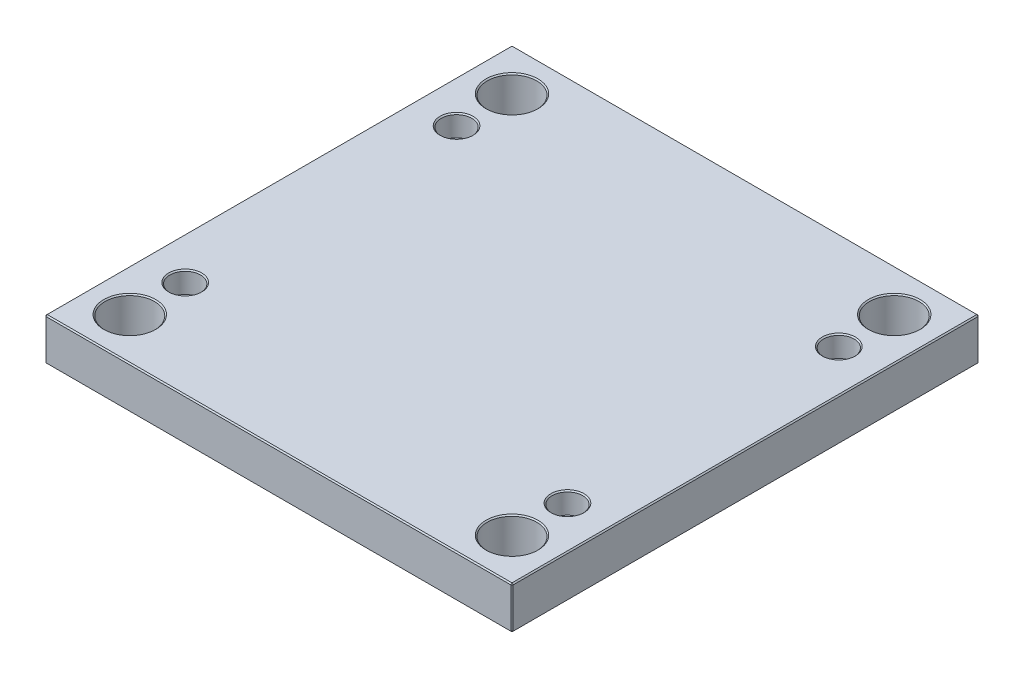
ISO-10303-21;
HEADER;
FILE_DESCRIPTION(('STEP AP214'),'2;1');
FILE_NAME('part.step','',(''),(''),'','','');
FILE_SCHEMA(('AUTOMOTIVE_DESIGN { 1 0 10303 214 1 1 1 1 }'));
ENDSEC;
DATA;
#1=APPLICATION_CONTEXT('core data for automotive mechanical design processes');
#2=APPLICATION_PROTOCOL_DEFINITION('international standard','automotive_design',2000,#1);
#3=PRODUCT_CONTEXT('',#1,'mechanical');
#4=PRODUCT('Part','Part','',(#3));
#5=PRODUCT_RELATED_PRODUCT_CATEGORY('part','',(#4));
#6=PRODUCT_DEFINITION_FORMATION('','',#4);
#7=PRODUCT_DEFINITION_CONTEXT('part definition',#1,'design');
#8=PRODUCT_DEFINITION('design','',#6,#7);
#9=PRODUCT_DEFINITION_SHAPE('','',#8);
#10=(LENGTH_UNIT() NAMED_UNIT(*) SI_UNIT(.MILLI.,.METRE.));
#11=(NAMED_UNIT(*) PLANE_ANGLE_UNIT() SI_UNIT($,.RADIAN.));
#12=(NAMED_UNIT(*) SI_UNIT($,.STERADIAN.) SOLID_ANGLE_UNIT());
#13=UNCERTAINTY_MEASURE_WITH_UNIT(LENGTH_MEASURE(1.E-05),#10,'distance_accuracy_value','');
#14=(GEOMETRIC_REPRESENTATION_CONTEXT(3) GLOBAL_UNCERTAINTY_ASSIGNED_CONTEXT((#13)) GLOBAL_UNIT_ASSIGNED_CONTEXT((#10,
#11,#12)) REPRESENTATION_CONTEXT('',''));
#15=CARTESIAN_POINT('',(0.,0.,0.));
#16=DIRECTION('',(0.,0.,1.));
#17=DIRECTION('',(1.,0.,0.));
#18=AXIS2_PLACEMENT_3D('',#15,#16,#17);
#19=CARTESIAN_POINT('',(-198.,36.,198.));
#20=DIRECTION('',(1.,0.,0.));
#21=DIRECTION('',(0.,0.,-1.));
#22=AXIS2_PLACEMENT_3D('',#19,#20,#21);
#23=PLANE('',#22);
#24=DIRECTION('',(0.,-1.,0.));
#25=VECTOR('',#24,1.);
#26=CARTESIAN_POINT('',(-198.,36.,-197.));
#27=LINE('',#26,#25);
#28=CARTESIAN_POINT('',(-198.,35.,-197.));
#29=VERTEX_POINT('',#28);
#30=CARTESIAN_POINT('',(-198.,1.00000000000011,-197.));
#31=VERTEX_POINT('',#30);
#32=EDGE_CURVE('E115',#29,#31,#27,.T.);
#33=ORIENTED_EDGE('',*,*,#32,.T.);
#34=DIRECTION('',(0.,0.,1.));
#35=VECTOR('',#34,1.);
#36=CARTESIAN_POINT('',(-198.,1.00000000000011,198.));
#37=LINE('',#36,#35);
#38=CARTESIAN_POINT('',(-198.,1.00000000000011,197.));
#39=VERTEX_POINT('',#38);
#40=EDGE_CURVE('E111',#31,#39,#37,.T.);
#41=ORIENTED_EDGE('',*,*,#40,.T.);
#42=DIRECTION('',(0.,1.,0.));
#43=VECTOR('',#42,1.);
#44=CARTESIAN_POINT('',(-198.,36.,197.));
#45=LINE('',#44,#43);
#46=CARTESIAN_POINT('',(-198.,35.,197.));
#47=VERTEX_POINT('',#46);
#48=EDGE_CURVE('E104',#39,#47,#45,.T.);
#49=ORIENTED_EDGE('',*,*,#48,.T.);
#50=DIRECTION('',(0.,0.,-1.));
#51=VECTOR('',#50,1.);
#52=CARTESIAN_POINT('',(-198.,35.,-198.));
#53=LINE('',#52,#51);
#54=EDGE_CURVE('E108',#47,#29,#53,.T.);
#55=ORIENTED_EDGE('',*,*,#54,.T.);
#56=EDGE_LOOP('',(#33,#41,#49,#55));
#57=FACE_BOUND('',#56,.T.);
#58=ADVANCED_FACE('F16',(#57),#23,.F.);
#59=CARTESIAN_POINT('',(198.,36.,198.));
#60=DIRECTION('',(0.,0.,-1.));
#61=DIRECTION('',(-1.,0.,0.));
#62=AXIS2_PLACEMENT_3D('',#59,#60,#61);
#63=PLANE('',#62);
#64=DIRECTION('',(-1.,0.,0.));
#65=VECTOR('',#64,1.);
#66=CARTESIAN_POINT('',(-198.,35.,198.));
#67=LINE('',#66,#65);
#68=CARTESIAN_POINT('',(197.,35.,198.));
#69=VERTEX_POINT('',#68);
#70=CARTESIAN_POINT('',(-197.,35.,198.));
#71=VERTEX_POINT('',#70);
#72=EDGE_CURVE('E170',#69,#71,#67,.T.);
#73=ORIENTED_EDGE('',*,*,#72,.T.);
#74=DIRECTION('',(0.,-1.,0.));
#75=VECTOR('',#74,1.);
#76=CARTESIAN_POINT('',(-197.,36.,198.));
#77=LINE('',#76,#75);
#78=CARTESIAN_POINT('',(-197.,1.00000000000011,198.));
#79=VERTEX_POINT('',#78);
#80=EDGE_CURVE('E123',#71,#79,#77,.T.);
#81=ORIENTED_EDGE('',*,*,#80,.T.);
#82=DIRECTION('',(1.,0.,0.));
#83=VECTOR('',#82,1.);
#84=CARTESIAN_POINT('',(198.,1.00000000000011,198.));
#85=LINE('',#84,#83);
#86=CARTESIAN_POINT('',(197.,1.00000000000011,198.));
#87=VERTEX_POINT('',#86);
#88=EDGE_CURVE('E174',#79,#87,#85,.T.);
#89=ORIENTED_EDGE('',*,*,#88,.T.);
#90=DIRECTION('',(0.,1.,0.));
#91=VECTOR('',#90,1.);
#92=CARTESIAN_POINT('',(197.,36.,198.));
#93=LINE('',#92,#91);
#94=EDGE_CURVE('E172',#87,#69,#93,.T.);
#95=ORIENTED_EDGE('',*,*,#94,.T.);
#96=EDGE_LOOP('',(#73,#81,#89,#95));
#97=FACE_BOUND('',#96,.T.);
#98=ADVANCED_FACE('F413',(#97),#63,.F.);
#99=CARTESIAN_POINT('',(198.,36.,198.));
#100=DIRECTION('',(-1.,0.,0.));
#101=DIRECTION('',(0.,0.,1.));
#102=AXIS2_PLACEMENT_3D('',#99,#100,#101);
#103=PLANE('',#102);
#104=DIRECTION('',(0.,0.,-1.));
#105=VECTOR('',#104,1.);
#106=CARTESIAN_POINT('',(198.,1.00000000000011,198.));
#107=LINE('',#106,#105);
#108=CARTESIAN_POINT('',(198.,1.00000000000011,197.));
#109=VERTEX_POINT('',#108);
#110=CARTESIAN_POINT('',(198.,1.00000000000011,-197.));
#111=VERTEX_POINT('',#110);
#112=EDGE_CURVE('E165',#109,#111,#107,.T.);
#113=ORIENTED_EDGE('',*,*,#112,.T.);
#114=DIRECTION('',(0.,1.,0.));
#115=VECTOR('',#114,1.);
#116=CARTESIAN_POINT('',(198.,36.,-197.));
#117=LINE('',#116,#115);
#118=CARTESIAN_POINT('',(198.,35.,-197.));
#119=VERTEX_POINT('',#118);
#120=EDGE_CURVE('E167',#111,#119,#117,.T.);
#121=ORIENTED_EDGE('',*,*,#120,.T.);
#122=DIRECTION('',(0.,0.,1.));
#123=VECTOR('',#122,1.);
#124=CARTESIAN_POINT('',(198.,35.,198.));
#125=LINE('',#124,#123);
#126=CARTESIAN_POINT('',(198.,35.,197.));
#127=VERTEX_POINT('',#126);
#128=EDGE_CURVE('E161',#119,#127,#125,.T.);
#129=ORIENTED_EDGE('',*,*,#128,.T.);
#130=DIRECTION('',(0.,-1.,0.));
#131=VECTOR('',#130,1.);
#132=CARTESIAN_POINT('',(198.,36.,197.));
#133=LINE('',#132,#131);
#134=EDGE_CURVE('E163',#127,#109,#133,.T.);
#135=ORIENTED_EDGE('',*,*,#134,.T.);
#136=EDGE_LOOP('',(#113,#121,#129,#135));
#137=FACE_BOUND('',#136,.T.);
#138=ADVANCED_FACE('F406',(#137),#103,.F.);
#139=CARTESIAN_POINT('',(198.,36.,-198.));
#140=DIRECTION('',(0.,0.,1.));
#141=DIRECTION('',(1.,0.,0.));
#142=AXIS2_PLACEMENT_3D('',#139,#140,#141);
#143=PLANE('',#142);
#144=DIRECTION('',(0.,-1.,0.));
#145=VECTOR('',#144,1.);
#146=CARTESIAN_POINT('',(197.,36.,-198.));
#147=LINE('',#146,#145);
#148=CARTESIAN_POINT('',(197.,35.,-198.));
#149=VERTEX_POINT('',#148);
#150=CARTESIAN_POINT('',(197.,1.00000000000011,-198.));
#151=VERTEX_POINT('',#150);
#152=EDGE_CURVE('E154',#149,#151,#147,.T.);
#153=ORIENTED_EDGE('',*,*,#152,.T.);
#154=DIRECTION('',(-1.,0.,0.));
#155=VECTOR('',#154,1.);
#156=CARTESIAN_POINT('',(198.,1.00000000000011,-198.));
#157=LINE('',#156,#155);
#158=CARTESIAN_POINT('',(-197.,1.00000000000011,-198.));
#159=VERTEX_POINT('',#158);
#160=EDGE_CURVE('E159',#151,#159,#157,.T.);
#161=ORIENTED_EDGE('',*,*,#160,.T.);
#162=DIRECTION('',(0.,1.,0.));
#163=VECTOR('',#162,1.);
#164=CARTESIAN_POINT('',(-197.,36.,-198.));
#165=LINE('',#164,#163);
#166=CARTESIAN_POINT('',(-197.,35.,-198.));
#167=VERTEX_POINT('',#166);
#168=EDGE_CURVE('E156',#159,#167,#165,.T.);
#169=ORIENTED_EDGE('',*,*,#168,.T.);
#170=DIRECTION('',(1.,0.,0.));
#171=VECTOR('',#170,1.);
#172=CARTESIAN_POINT('',(198.,35.,-198.));
#173=LINE('',#172,#171);
#174=EDGE_CURVE('E152',#167,#149,#173,.T.);
#175=ORIENTED_EDGE('',*,*,#174,.T.);
#176=EDGE_LOOP('',(#153,#161,#169,#175));
#177=FACE_BOUND('',#176,.T.);
#178=ADVANCED_FACE('F431',(#177),#143,.F.);
#179=CARTESIAN_POINT('',(0.,36.,0.));
#180=DIRECTION('',(0.,1.,0.));
#181=DIRECTION('',(0.,0.,1.));
#182=AXIS2_PLACEMENT_3D('',#179,#180,#181);
#183=PLANE('',#182);
#184=CARTESIAN_POINT('',(-162.,36.,162.));
#185=DIRECTION('',(0.,1.,0.));
#186=DIRECTION('',(0.,0.,1.));
#187=AXIS2_PLACEMENT_3D('',#184,#185,#186);
#188=CIRCLE('',#187,22.);
#189=CARTESIAN_POINT('',(-162.,36.,184.));
#190=VERTEX_POINT('',#189);
#191=EDGE_CURVE('E317',#190,#190,#188,.F.);
#192=ORIENTED_EDGE('',*,*,#191,.T.);
#193=EDGE_LOOP('',(#192));
#194=FACE_BOUND('',#193,.T.);
#195=CARTESIAN_POINT('',(162.,36.,162.));
#196=DIRECTION('',(0.,1.,0.));
#197=DIRECTION('',(0.,0.,1.));
#198=AXIS2_PLACEMENT_3D('',#195,#196,#197);
#199=CIRCLE('',#198,22.);
#200=CARTESIAN_POINT('',(162.,36.,184.));
#201=VERTEX_POINT('',#200);
#202=EDGE_CURVE('E314',#201,#201,#199,.F.);
#203=ORIENTED_EDGE('',*,*,#202,.T.);
#204=EDGE_LOOP('',(#203));
#205=FACE_BOUND('',#204,.T.);
#206=CARTESIAN_POINT('',(162.,36.,-162.));
#207=DIRECTION('',(0.,1.,0.));
#208=DIRECTION('',(0.,0.,1.));
#209=AXIS2_PLACEMENT_3D('',#206,#207,#208);
#210=CIRCLE('',#209,22.);
#211=CARTESIAN_POINT('',(162.,36.,-140.));
#212=VERTEX_POINT('',#211);
#213=EDGE_CURVE('E311',#212,#212,#210,.F.);
#214=ORIENTED_EDGE('',*,*,#213,.T.);
#215=EDGE_LOOP('',(#214));
#216=FACE_BOUND('',#215,.T.);
#217=CARTESIAN_POINT('',(-162.,36.,-162.));
#218=DIRECTION('',(0.,1.,0.));
#219=DIRECTION('',(0.,0.,1.));
#220=AXIS2_PLACEMENT_3D('',#217,#218,#219);
#221=CIRCLE('',#220,22.);
#222=CARTESIAN_POINT('',(-162.,36.,-140.));
#223=VERTEX_POINT('',#222);
#224=EDGE_CURVE('E308',#223,#223,#221,.F.);
#225=ORIENTED_EDGE('',*,*,#224,.T.);
#226=EDGE_LOOP('',(#225));
#227=FACE_BOUND('',#226,.T.);
#228=CARTESIAN_POINT('',(-162.,36.,115.));
#229=DIRECTION('',(0.,1.,0.));
#230=DIRECTION('',(0.,0.,1.));
#231=AXIS2_PLACEMENT_3D('',#228,#229,#230);
#232=CIRCLE('',#231,14.);
#233=CARTESIAN_POINT('',(-162.,36.,129.));
#234=VERTEX_POINT('',#233);
#235=EDGE_CURVE('E290',#234,#234,#232,.F.);
#236=ORIENTED_EDGE('',*,*,#235,.T.);
#237=EDGE_LOOP('',(#236));
#238=FACE_BOUND('',#237,.T.);
#239=CARTESIAN_POINT('',(162.,36.,115.));
#240=DIRECTION('',(0.,1.,0.));
#241=DIRECTION('',(0.,0.,1.));
#242=AXIS2_PLACEMENT_3D('',#239,#240,#241);
#243=CIRCLE('',#242,13.9999999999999);
#244=CARTESIAN_POINT('',(162.,36.,129.));
#245=VERTEX_POINT('',#244);
#246=EDGE_CURVE('E287',#245,#245,#243,.F.);
#247=ORIENTED_EDGE('',*,*,#246,.T.);
#248=EDGE_LOOP('',(#247));
#249=FACE_BOUND('',#248,.T.);
#250=CARTESIAN_POINT('',(162.,36.,-115.));
#251=DIRECTION('',(0.,1.,0.));
#252=DIRECTION('',(0.,0.,1.));
#253=AXIS2_PLACEMENT_3D('',#250,#251,#252);
#254=CIRCLE('',#253,13.9999999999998);
#255=CARTESIAN_POINT('',(162.,36.,-101.));
#256=VERTEX_POINT('',#255);
#257=EDGE_CURVE('E284',#256,#256,#254,.F.);
#258=ORIENTED_EDGE('',*,*,#257,.T.);
#259=EDGE_LOOP('',(#258));
#260=FACE_BOUND('',#259,.T.);
#261=CARTESIAN_POINT('',(-162.,36.,-115.));
#262=DIRECTION('',(0.,1.,0.));
#263=DIRECTION('',(0.,0.,1.));
#264=AXIS2_PLACEMENT_3D('',#261,#262,#263);
#265=CIRCLE('',#264,14.);
#266=CARTESIAN_POINT('',(-162.,36.,-101.));
#267=VERTEX_POINT('',#266);
#268=EDGE_CURVE('E281',#267,#267,#265,.F.);
#269=ORIENTED_EDGE('',*,*,#268,.T.);
#270=EDGE_LOOP('',(#269));
#271=FACE_BOUND('',#270,.T.);
#272=DIRECTION('',(0.,0.,-1.));
#273=VECTOR('',#272,1.);
#274=CARTESIAN_POINT('',(197.,36.,-198.));
#275=LINE('',#274,#273);
#276=CARTESIAN_POINT('',(197.,36.,197.));
#277=VERTEX_POINT('',#276);
#278=CARTESIAN_POINT('',(197.,36.,-197.));
#279=VERTEX_POINT('',#278);
#280=EDGE_CURVE('E31',#277,#279,#275,.T.);
#281=ORIENTED_EDGE('',*,*,#280,.T.);
#282=DIRECTION('',(-1.,0.,0.));
#283=VECTOR('',#282,1.);
#284=CARTESIAN_POINT('',(-198.,36.,-197.));
#285=LINE('',#284,#283);
#286=CARTESIAN_POINT('',(-197.,36.,-197.));
#287=VERTEX_POINT('',#286);
#288=EDGE_CURVE('E190',#279,#287,#285,.T.);
#289=ORIENTED_EDGE('',*,*,#288,.T.);
#290=DIRECTION('',(0.,0.,1.));
#291=VECTOR('',#290,1.);
#292=CARTESIAN_POINT('',(-197.,36.,198.));
#293=LINE('',#292,#291);
#294=CARTESIAN_POINT('',(-197.,36.,197.));
#295=VERTEX_POINT('',#294);
#296=EDGE_CURVE('E186',#287,#295,#293,.T.);
#297=ORIENTED_EDGE('',*,*,#296,.T.);
#298=DIRECTION('',(1.,0.,0.));
#299=VECTOR('',#298,1.);
#300=CARTESIAN_POINT('',(198.,36.,197.));
#301=LINE('',#300,#299);
#302=EDGE_CURVE('E36',#295,#277,#301,.T.);
#303=ORIENTED_EDGE('',*,*,#302,.T.);
#304=EDGE_LOOP('',(#281,#289,#297,#303));
#305=FACE_BOUND('',#304,.T.);
#306=ADVANCED_FACE('F357',(#194,#205,#216,#227,#238,#249,#260,#271,#305),#183,.T.);
#307=CARTESIAN_POINT('',(0.,0.,0.));
#308=DIRECTION('',(0.,1.,0.));
#309=DIRECTION('',(0.,0.,1.));
#310=AXIS2_PLACEMENT_3D('',#307,#308,#309);
#311=PLANE('',#310);
#312=CARTESIAN_POINT('',(-162.,0.,162.));
#313=DIRECTION('',(0.,1.,0.));
#314=DIRECTION('',(0.,0.,1.));
#315=AXIS2_PLACEMENT_3D('',#312,#313,#314);
#316=CIRCLE('',#315,22.);
#317=CARTESIAN_POINT('',(-162.,0.,184.));
#318=VERTEX_POINT('',#317);
#319=EDGE_CURVE('E329',#318,#318,#316,.T.);
#320=ORIENTED_EDGE('',*,*,#319,.T.);
#321=EDGE_LOOP('',(#320));
#322=FACE_BOUND('',#321,.T.);
#323=CARTESIAN_POINT('',(162.,0.,162.));
#324=DIRECTION('',(0.,1.,0.));
#325=DIRECTION('',(0.,0.,1.));
#326=AXIS2_PLACEMENT_3D('',#323,#324,#325);
#327=CIRCLE('',#326,22.);
#328=CARTESIAN_POINT('',(162.,0.,184.));
#329=VERTEX_POINT('',#328);
#330=EDGE_CURVE('E326',#329,#329,#327,.T.);
#331=ORIENTED_EDGE('',*,*,#330,.T.);
#332=EDGE_LOOP('',(#331));
#333=FACE_BOUND('',#332,.T.);
#334=CARTESIAN_POINT('',(162.,0.,-162.));
#335=DIRECTION('',(0.,1.,0.));
#336=DIRECTION('',(0.,0.,1.));
#337=AXIS2_PLACEMENT_3D('',#334,#335,#336);
#338=CIRCLE('',#337,22.);
#339=CARTESIAN_POINT('',(162.,0.,-140.));
#340=VERTEX_POINT('',#339);
#341=EDGE_CURVE('E323',#340,#340,#338,.T.);
#342=ORIENTED_EDGE('',*,*,#341,.T.);
#343=EDGE_LOOP('',(#342));
#344=FACE_BOUND('',#343,.T.);
#345=CARTESIAN_POINT('',(-162.,0.,-162.));
#346=DIRECTION('',(0.,1.,0.));
#347=DIRECTION('',(0.,0.,1.));
#348=AXIS2_PLACEMENT_3D('',#345,#346,#347);
#349=CIRCLE('',#348,22.);
#350=CARTESIAN_POINT('',(-162.,0.,-140.));
#351=VERTEX_POINT('',#350);
#352=EDGE_CURVE('E320',#351,#351,#349,.T.);
#353=ORIENTED_EDGE('',*,*,#352,.T.);
#354=EDGE_LOOP('',(#353));
#355=FACE_BOUND('',#354,.T.);
#356=CARTESIAN_POINT('',(162.,0.,-115.));
#357=DIRECTION('',(0.,1.,0.));
#358=DIRECTION('',(0.,0.,1.));
#359=AXIS2_PLACEMENT_3D('',#356,#357,#358);
#360=CIRCLE('',#359,10.0000000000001);
#361=CARTESIAN_POINT('',(162.,0.,-105.));
#362=VERTEX_POINT('',#361);
#363=EDGE_CURVE('E263',#362,#362,#360,.T.);
#364=ORIENTED_EDGE('',*,*,#363,.T.);
#365=EDGE_LOOP('',(#364));
#366=FACE_BOUND('',#365,.T.);
#367=CARTESIAN_POINT('',(162.,0.,115.));
#368=DIRECTION('',(0.,1.,0.));
#369=DIRECTION('',(0.,0.,1.));
#370=AXIS2_PLACEMENT_3D('',#367,#368,#369);
#371=CIRCLE('',#370,10.);
#372=CARTESIAN_POINT('',(162.,0.,125.));
#373=VERTEX_POINT('',#372);
#374=EDGE_CURVE('E260',#373,#373,#371,.T.);
#375=ORIENTED_EDGE('',*,*,#374,.T.);
#376=EDGE_LOOP('',(#375));
#377=FACE_BOUND('',#376,.T.);
#378=CARTESIAN_POINT('',(-162.,0.,115.));
#379=DIRECTION('',(0.,1.,0.));
#380=DIRECTION('',(0.,0.,1.));
#381=AXIS2_PLACEMENT_3D('',#378,#379,#380);
#382=CIRCLE('',#381,10.);
#383=CARTESIAN_POINT('',(-162.,0.,125.));
#384=VERTEX_POINT('',#383);
#385=EDGE_CURVE('E257',#384,#384,#382,.T.);
#386=ORIENTED_EDGE('',*,*,#385,.T.);
#387=EDGE_LOOP('',(#386));
#388=FACE_BOUND('',#387,.T.);
#389=CARTESIAN_POINT('',(-162.,0.,-115.));
#390=DIRECTION('',(0.,1.,0.));
#391=DIRECTION('',(0.,0.,1.));
#392=AXIS2_PLACEMENT_3D('',#389,#390,#391);
#393=CIRCLE('',#392,10.0000000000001);
#394=CARTESIAN_POINT('',(-162.,0.,-105.));
#395=VERTEX_POINT('',#394);
#396=EDGE_CURVE('E192',#395,#395,#393,.T.);
#397=ORIENTED_EDGE('',*,*,#396,.T.);
#398=EDGE_LOOP('',(#397));
#399=FACE_BOUND('',#398,.T.);
#400=DIRECTION('',(0.,0.,1.));
#401=VECTOR('',#400,1.);
#402=CARTESIAN_POINT('',(197.,0.,0.));
#403=LINE('',#402,#401);
#404=CARTESIAN_POINT('',(197.,0.,-197.));
#405=VERTEX_POINT('',#404);
#406=CARTESIAN_POINT('',(197.,0.,197.));
#407=VERTEX_POINT('',#406);
#408=EDGE_CURVE('E177',#405,#407,#403,.T.);
#409=ORIENTED_EDGE('',*,*,#408,.T.);
#410=DIRECTION('',(-1.,0.,0.));
#411=VECTOR('',#410,1.);
#412=CARTESIAN_POINT('',(0.,0.,197.));
#413=LINE('',#412,#411);
#414=CARTESIAN_POINT('',(-197.,0.,197.));
#415=VERTEX_POINT('',#414);
#416=EDGE_CURVE('E183',#407,#415,#413,.T.);
#417=ORIENTED_EDGE('',*,*,#416,.T.);
#418=DIRECTION('',(0.,0.,-1.));
#419=VECTOR('',#418,1.);
#420=CARTESIAN_POINT('',(-197.,0.,0.));
#421=LINE('',#420,#419);
#422=CARTESIAN_POINT('',(-197.,0.,-197.));
#423=VERTEX_POINT('',#422);
#424=EDGE_CURVE('E181',#415,#423,#421,.T.);
#425=ORIENTED_EDGE('',*,*,#424,.T.);
#426=DIRECTION('',(1.,0.,0.));
#427=VECTOR('',#426,1.);
#428=CARTESIAN_POINT('',(0.,0.,-197.));
#429=LINE('',#428,#427);
#430=EDGE_CURVE('E179',#423,#405,#429,.T.);
#431=ORIENTED_EDGE('',*,*,#430,.T.);
#432=EDGE_LOOP('',(#409,#417,#425,#431));
#433=FACE_BOUND('',#432,.T.);
#434=ADVANCED_FACE('F353',(#322,#333,#344,#355,#366,#377,#388,#399,#433),#311,.F.);
#435=CARTESIAN_POINT('',(198.,36.,197.));
#436=DIRECTION('',(-0.707106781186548,0.,-0.707106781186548));
#437=DIRECTION('',(0.,-1.,0.));
#438=AXIS2_PLACEMENT_3D('',#435,#436,#437);
#439=PLANE('',#438);
#440=DIRECTION('',(-0.707106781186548,0.,0.707106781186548));
#441=VECTOR('',#440,1.);
#442=CARTESIAN_POINT('',(197.,35.,198.));
#443=LINE('',#442,#441);
#444=EDGE_CURVE('E141',#69,#127,#443,.F.);
#445=ORIENTED_EDGE('',*,*,#444,.F.);
#446=ORIENTED_EDGE('',*,*,#94,.F.);
#447=DIRECTION('',(0.707106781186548,0.,-0.707106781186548));
#448=VECTOR('',#447,1.);
#449=CARTESIAN_POINT('',(197.,1.00000000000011,198.));
#450=LINE('',#449,#448);
#451=EDGE_CURVE('E144',#109,#87,#450,.F.);
#452=ORIENTED_EDGE('',*,*,#451,.F.);
#453=ORIENTED_EDGE('',*,*,#134,.F.);
#454=EDGE_LOOP('',(#445,#446,#452,#453));
#455=FACE_BOUND('',#454,.T.);
#456=ADVANCED_FACE('F356',(#455),#439,.F.);
#457=CARTESIAN_POINT('',(197.,35.,198.));
#458=DIRECTION('',(0.577350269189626,0.577350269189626,0.577350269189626));
#459=DIRECTION('',(0.707106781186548,0.,-0.707106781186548));
#460=AXIS2_PLACEMENT_3D('',#457,#458,#459);
#461=PLANE('',#460);
#462=DIRECTION('',(0.,-0.707106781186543,0.707106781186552));
#463=VECTOR('',#462,1.);
#464=CARTESIAN_POINT('',(197.,35.,198.));
#465=LINE('',#464,#463);
#466=EDGE_CURVE('E235',#69,#277,#465,.F.);
#467=ORIENTED_EDGE('',*,*,#466,.F.);
#468=ORIENTED_EDGE('',*,*,#444,.T.);
#469=DIRECTION('',(-0.707106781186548,0.707106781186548,0.));
#470=VECTOR('',#469,1.);
#471=CARTESIAN_POINT('',(197.5,35.5,197.));
#472=LINE('',#471,#470);
#473=EDGE_CURVE('E237',#277,#127,#472,.F.);
#474=ORIENTED_EDGE('',*,*,#473,.F.);
#475=EDGE_LOOP('',(#467,#468,#474));
#476=FACE_BOUND('',#475,.T.);
#477=ADVANCED_FACE('F419',(#476),#461,.T.);
#478=CARTESIAN_POINT('',(197.,1.00000000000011,198.));
#479=DIRECTION('',(0.577350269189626,-0.577350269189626,0.577350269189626));
#480=DIRECTION('',(0.707106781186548,0.,-0.707106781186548));
#481=AXIS2_PLACEMENT_3D('',#478,#479,#480);
#482=PLANE('',#481);
#483=DIRECTION('',(-0.707106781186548,-0.707106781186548,0.));
#484=VECTOR('',#483,1.);
#485=CARTESIAN_POINT('',(197.5,0.500000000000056,197.));
#486=LINE('',#485,#484);
#487=EDGE_CURVE('E229',#109,#407,#486,.T.);
#488=ORIENTED_EDGE('',*,*,#487,.F.);
#489=ORIENTED_EDGE('',*,*,#451,.T.);
#490=DIRECTION('',(0.,0.707106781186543,0.707106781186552));
#491=VECTOR('',#490,1.);
#492=CARTESIAN_POINT('',(197.,1.00000000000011,198.));
#493=LINE('',#492,#491);
#494=EDGE_CURVE('E232',#407,#87,#493,.T.);
#495=ORIENTED_EDGE('',*,*,#494,.F.);
#496=EDGE_LOOP('',(#488,#489,#495));
#497=FACE_BOUND('',#496,.T.);
#498=ADVANCED_FACE('F378',(#497),#482,.T.);
#499=CARTESIAN_POINT('',(197.,36.,0.));
#500=DIRECTION('',(0.707106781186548,0.707106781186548,0.));
#501=DIRECTION('',(0.,0.,1.));
#502=AXIS2_PLACEMENT_3D('',#499,#500,#501);
#503=PLANE('',#502);
#504=ORIENTED_EDGE('',*,*,#473,.T.);
#505=ORIENTED_EDGE('',*,*,#128,.F.);
#506=DIRECTION('',(0.707106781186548,-0.707106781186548,0.));
#507=VECTOR('',#506,1.);
#508=CARTESIAN_POINT('',(198.,35.,-197.));
#509=LINE('',#508,#507);
#510=EDGE_CURVE('E224',#279,#119,#509,.T.);
#511=ORIENTED_EDGE('',*,*,#510,.F.);
#512=ORIENTED_EDGE('',*,*,#280,.F.);
#513=EDGE_LOOP('',(#504,#505,#511,#512));
#514=FACE_BOUND('',#513,.T.);
#515=ADVANCED_FACE('F421',(#514),#503,.T.);
#516=CARTESIAN_POINT('',(0.,36.,197.));
#517=DIRECTION('',(0.,0.707106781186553,0.707106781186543));
#518=DIRECTION('',(-1.,0.,0.));
#519=AXIS2_PLACEMENT_3D('',#516,#517,#518);
#520=PLANE('',#519);
#521=ORIENTED_EDGE('',*,*,#466,.T.);
#522=ORIENTED_EDGE('',*,*,#302,.F.);
#523=DIRECTION('',(0.,0.707106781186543,-0.707106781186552));
#524=VECTOR('',#523,1.);
#525=CARTESIAN_POINT('',(-197.,35.5,197.5));
#526=LINE('',#525,#524);
#527=EDGE_CURVE('E127',#71,#295,#526,.T.);
#528=ORIENTED_EDGE('',*,*,#527,.F.);
#529=ORIENTED_EDGE('',*,*,#72,.F.);
#530=EDGE_LOOP('',(#521,#522,#528,#529));
#531=FACE_BOUND('',#530,.T.);
#532=ADVANCED_FACE('F416',(#531),#520,.T.);
#533=CARTESIAN_POINT('',(-197.,36.,198.));
#534=DIRECTION('',(0.707106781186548,0.,-0.707106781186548));
#535=DIRECTION('',(0.,-1.,0.));
#536=AXIS2_PLACEMENT_3D('',#533,#534,#535);
#537=PLANE('',#536);
#538=DIRECTION('',(0.707106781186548,0.,0.707106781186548));
#539=VECTOR('',#538,1.);
#540=CARTESIAN_POINT('',(-197.,1.00000000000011,198.));
#541=LINE('',#540,#539);
#542=EDGE_CURVE('E128',#79,#39,#541,.F.);
#543=ORIENTED_EDGE('',*,*,#542,.F.);
#544=ORIENTED_EDGE('',*,*,#80,.F.);
#545=DIRECTION('',(-0.707106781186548,0.,-0.707106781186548));
#546=VECTOR('',#545,1.);
#547=CARTESIAN_POINT('',(-198.,35.,197.));
#548=LINE('',#547,#546);
#549=EDGE_CURVE('E119',#47,#71,#548,.F.);
#550=ORIENTED_EDGE('',*,*,#549,.F.);
#551=ORIENTED_EDGE('',*,*,#48,.F.);
#552=EDGE_LOOP('',(#543,#544,#550,#551));
#553=FACE_BOUND('',#552,.T.);
#554=ADVANCED_FACE('F121',(#553),#537,.F.);
#555=CARTESIAN_POINT('',(198.,1.00000000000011,198.));
#556=DIRECTION('',(0.,0.707106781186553,-0.707106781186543));
#557=DIRECTION('',(1.,0.,0.));
#558=AXIS2_PLACEMENT_3D('',#555,#556,#557);
#559=PLANE('',#558);
#560=ORIENTED_EDGE('',*,*,#494,.T.);
#561=ORIENTED_EDGE('',*,*,#88,.F.);
#562=DIRECTION('',(0.,-0.707106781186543,-0.707106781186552));
#563=VECTOR('',#562,1.);
#564=CARTESIAN_POINT('',(-197.,1.00000000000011,198.));
#565=LINE('',#564,#563);
#566=EDGE_CURVE('E220',#415,#79,#565,.F.);
#567=ORIENTED_EDGE('',*,*,#566,.F.);
#568=ORIENTED_EDGE('',*,*,#416,.F.);
#569=EDGE_LOOP('',(#560,#561,#567,#568));
#570=FACE_BOUND('',#569,.T.);
#571=ADVANCED_FACE('F383',(#570),#559,.F.);
#572=CARTESIAN_POINT('',(198.,1.00000000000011,198.));
#573=DIRECTION('',(-0.707106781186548,0.707106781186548,0.));
#574=DIRECTION('',(0.,0.,-1.));
#575=AXIS2_PLACEMENT_3D('',#572,#573,#574);
#576=PLANE('',#575);
#577=ORIENTED_EDGE('',*,*,#487,.T.);
#578=ORIENTED_EDGE('',*,*,#408,.F.);
#579=DIRECTION('',(0.707106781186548,0.707106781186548,0.));
#580=VECTOR('',#579,1.);
#581=CARTESIAN_POINT('',(197.5,0.500000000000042,-197.));
#582=LINE('',#581,#580);
#583=EDGE_CURVE('E217',#111,#405,#582,.F.);
#584=ORIENTED_EDGE('',*,*,#583,.F.);
#585=ORIENTED_EDGE('',*,*,#112,.F.);
#586=EDGE_LOOP('',(#577,#578,#584,#585));
#587=FACE_BOUND('',#586,.T.);
#588=ADVANCED_FACE('F376',(#587),#576,.F.);
#589=CARTESIAN_POINT('',(197.,36.,-198.));
#590=DIRECTION('',(-0.707106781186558,0.,0.707106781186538));
#591=DIRECTION('',(0.,-1.,0.));
#592=AXIS2_PLACEMENT_3D('',#589,#590,#591);
#593=PLANE('',#592);
#594=DIRECTION('',(0.707106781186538,0.,0.707106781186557));
#595=VECTOR('',#594,1.);
#596=CARTESIAN_POINT('',(198.,35.,-197.));
#597=LINE('',#596,#595);
#598=EDGE_CURVE('E226',#119,#149,#597,.F.);
#599=ORIENTED_EDGE('',*,*,#598,.F.);
#600=ORIENTED_EDGE('',*,*,#120,.F.);
#601=DIRECTION('',(-0.707106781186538,0.,-0.707106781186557));
#602=VECTOR('',#601,1.);
#603=CARTESIAN_POINT('',(197.,1.00000000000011,-198.));
#604=LINE('',#603,#602);
#605=EDGE_CURVE('E214',#151,#111,#604,.F.);
#606=ORIENTED_EDGE('',*,*,#605,.F.);
#607=ORIENTED_EDGE('',*,*,#152,.F.);
#608=EDGE_LOOP('',(#599,#600,#606,#607));
#609=FACE_BOUND('',#608,.T.);
#610=ADVANCED_FACE('F403',(#609),#593,.F.);
#611=CARTESIAN_POINT('',(198.,35.,-197.));
#612=DIRECTION('',(0.577350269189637,0.577350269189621,-0.577350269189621));
#613=DIRECTION('',(-0.707106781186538,0.,-0.707106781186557));
#614=AXIS2_PLACEMENT_3D('',#611,#612,#613);
#615=PLANE('',#614);
#616=ORIENTED_EDGE('',*,*,#510,.T.);
#617=ORIENTED_EDGE('',*,*,#598,.T.);
#618=DIRECTION('',(0.,0.707106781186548,0.707106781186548));
#619=VECTOR('',#618,1.);
#620=CARTESIAN_POINT('',(197.,35.5,-197.5));
#621=LINE('',#620,#619);
#622=EDGE_CURVE('E135',#279,#149,#621,.F.);
#623=ORIENTED_EDGE('',*,*,#622,.F.);
#624=EDGE_LOOP('',(#616,#617,#623));
#625=FACE_BOUND('',#624,.T.);
#626=ADVANCED_FACE('F425',(#625),#615,.T.);
#627=CARTESIAN_POINT('',(-198.,35.,197.));
#628=DIRECTION('',(-0.577350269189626,0.577350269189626,0.577350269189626));
#629=DIRECTION('',(0.707106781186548,0.,0.707106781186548));
#630=AXIS2_PLACEMENT_3D('',#627,#628,#629);
#631=PLANE('',#630);
#632=ORIENTED_EDGE('',*,*,#549,.T.);
#633=ORIENTED_EDGE('',*,*,#527,.T.);
#634=DIRECTION('',(-0.707106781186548,-0.707106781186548,0.));
#635=VECTOR('',#634,1.);
#636=CARTESIAN_POINT('',(-198.,35.,197.));
#637=LINE('',#636,#635);
#638=EDGE_CURVE('E131',#47,#295,#637,.F.);
#639=ORIENTED_EDGE('',*,*,#638,.F.);
#640=EDGE_LOOP('',(#632,#633,#639));
#641=FACE_BOUND('',#640,.T.);
#642=ADVANCED_FACE('F132',(#641),#631,.T.);
#643=CARTESIAN_POINT('',(-197.,1.00000000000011,198.));
#644=DIRECTION('',(-0.577350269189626,-0.577350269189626,0.577350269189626));
#645=DIRECTION('',(0.707106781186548,0.,0.707106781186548));
#646=AXIS2_PLACEMENT_3D('',#643,#644,#645);
#647=PLANE('',#646);
#648=ORIENTED_EDGE('',*,*,#566,.T.);
#649=ORIENTED_EDGE('',*,*,#542,.T.);
#650=DIRECTION('',(-0.707106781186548,0.707106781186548,0.));
#651=VECTOR('',#650,1.);
#652=CARTESIAN_POINT('',(-197.5,0.500000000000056,197.));
#653=LINE('',#652,#651);
#654=EDGE_CURVE('E136',#415,#39,#653,.T.);
#655=ORIENTED_EDGE('',*,*,#654,.F.);
#656=EDGE_LOOP('',(#648,#649,#655));
#657=FACE_BOUND('',#656,.T.);
#658=ADVANCED_FACE('F386',(#657),#647,.T.);
#659=CARTESIAN_POINT('',(197.,1.00000000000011,-198.));
#660=DIRECTION('',(0.577350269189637,-0.577350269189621,-0.577350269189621));
#661=DIRECTION('',(-0.707106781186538,0.,-0.707106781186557));
#662=AXIS2_PLACEMENT_3D('',#659,#660,#661);
#663=PLANE('',#662);
#664=ORIENTED_EDGE('',*,*,#605,.T.);
#665=ORIENTED_EDGE('',*,*,#583,.T.);
#666=DIRECTION('',(0.,-0.707106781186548,0.707106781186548));
#667=VECTOR('',#666,1.);
#668=CARTESIAN_POINT('',(197.,1.00000000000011,-198.));
#669=LINE('',#668,#667);
#670=EDGE_CURVE('E207',#151,#405,#669,.T.);
#671=ORIENTED_EDGE('',*,*,#670,.F.);
#672=EDGE_LOOP('',(#664,#665,#671));
#673=FACE_BOUND('',#672,.T.);
#674=ADVANCED_FACE('F397',(#673),#663,.T.);
#675=CARTESIAN_POINT('',(0.,36.,-197.));
#676=DIRECTION('',(0.,0.707106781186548,-0.707106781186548));
#677=DIRECTION('',(1.,0.,0.));
#678=AXIS2_PLACEMENT_3D('',#675,#676,#677);
#679=PLANE('',#678);
#680=ORIENTED_EDGE('',*,*,#622,.T.);
#681=ORIENTED_EDGE('',*,*,#174,.F.);
#682=DIRECTION('',(0.,-0.707106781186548,-0.707106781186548));
#683=VECTOR('',#682,1.);
#684=CARTESIAN_POINT('',(-197.,35.,-198.));
#685=LINE('',#684,#683);
#686=EDGE_CURVE('E204',#287,#167,#685,.T.);
#687=ORIENTED_EDGE('',*,*,#686,.F.);
#688=ORIENTED_EDGE('',*,*,#288,.F.);
#689=EDGE_LOOP('',(#680,#681,#687,#688));
#690=FACE_BOUND('',#689,.T.);
#691=ADVANCED_FACE('F429',(#690),#679,.T.);
#692=CARTESIAN_POINT('',(-197.,36.,0.));
#693=DIRECTION('',(-0.707106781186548,0.707106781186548,0.));
#694=DIRECTION('',(0.,0.,-1.));
#695=AXIS2_PLACEMENT_3D('',#692,#693,#694);
#696=PLANE('',#695);
#697=ORIENTED_EDGE('',*,*,#638,.T.);
#698=ORIENTED_EDGE('',*,*,#296,.F.);
#699=DIRECTION('',(0.707106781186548,0.707106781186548,0.));
#700=VECTOR('',#699,1.);
#701=CARTESIAN_POINT('',(-197.5,35.5,-197.));
#702=LINE('',#701,#700);
#703=EDGE_CURVE('E139',#29,#287,#702,.T.);
#704=ORIENTED_EDGE('',*,*,#703,.F.);
#705=ORIENTED_EDGE('',*,*,#54,.F.);
#706=EDGE_LOOP('',(#697,#698,#704,#705));
#707=FACE_BOUND('',#706,.T.);
#708=ADVANCED_FACE('F138',(#707),#696,.T.);
#709=CARTESIAN_POINT('',(-198.,1.00000000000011,198.));
#710=DIRECTION('',(0.707106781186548,0.707106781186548,0.));
#711=DIRECTION('',(0.,0.,1.));
#712=AXIS2_PLACEMENT_3D('',#709,#710,#711);
#713=PLANE('',#712);
#714=ORIENTED_EDGE('',*,*,#654,.T.);
#715=ORIENTED_EDGE('',*,*,#40,.F.);
#716=DIRECTION('',(0.707106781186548,-0.707106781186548,0.));
#717=VECTOR('',#716,1.);
#718=CARTESIAN_POINT('',(-198.,1.00000000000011,-197.));
#719=LINE('',#718,#717);
#720=EDGE_CURVE('E200',#423,#31,#719,.F.);
#721=ORIENTED_EDGE('',*,*,#720,.F.);
#722=ORIENTED_EDGE('',*,*,#424,.F.);
#723=EDGE_LOOP('',(#714,#715,#721,#722));
#724=FACE_BOUND('',#723,.T.);
#725=ADVANCED_FACE('F388',(#724),#713,.F.);
#726=CARTESIAN_POINT('',(198.,1.00000000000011,-198.));
#727=DIRECTION('',(0.,0.707106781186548,0.707106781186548));
#728=DIRECTION('',(-1.,0.,0.));
#729=AXIS2_PLACEMENT_3D('',#726,#727,#728);
#730=PLANE('',#729);
#731=ORIENTED_EDGE('',*,*,#670,.T.);
#732=ORIENTED_EDGE('',*,*,#430,.F.);
#733=DIRECTION('',(0.,0.707106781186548,-0.707106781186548));
#734=VECTOR('',#733,1.);
#735=CARTESIAN_POINT('',(-197.,0.500000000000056,-197.5));
#736=LINE('',#735,#734);
#737=EDGE_CURVE('E197',#159,#423,#736,.F.);
#738=ORIENTED_EDGE('',*,*,#737,.F.);
#739=ORIENTED_EDGE('',*,*,#160,.F.);
#740=EDGE_LOOP('',(#731,#732,#738,#739));
#741=FACE_BOUND('',#740,.T.);
#742=ADVANCED_FACE('F392',(#741),#730,.F.);
#743=CARTESIAN_POINT('',(-197.,35.,-198.));
#744=DIRECTION('',(-0.577350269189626,0.577350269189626,-0.577350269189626));
#745=DIRECTION('',(-0.707106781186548,0.,0.707106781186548));
#746=AXIS2_PLACEMENT_3D('',#743,#744,#745);
#747=PLANE('',#746);
#748=ORIENTED_EDGE('',*,*,#703,.T.);
#749=ORIENTED_EDGE('',*,*,#686,.T.);
#750=DIRECTION('',(0.707106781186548,0.,-0.707106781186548));
#751=VECTOR('',#750,1.);
#752=CARTESIAN_POINT('',(-197.,35.,-198.));
#753=LINE('',#752,#751);
#754=EDGE_CURVE('E195',#29,#167,#753,.T.);
#755=ORIENTED_EDGE('',*,*,#754,.F.);
#756=EDGE_LOOP('',(#748,#749,#755));
#757=FACE_BOUND('',#756,.T.);
#758=ADVANCED_FACE('F460',(#757),#747,.T.);
#759=CARTESIAN_POINT('',(-198.,1.00000000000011,-197.));
#760=DIRECTION('',(-0.577350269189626,-0.577350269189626,-0.577350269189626));
#761=DIRECTION('',(-0.707106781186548,0.,0.707106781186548));
#762=AXIS2_PLACEMENT_3D('',#759,#760,#761);
#763=PLANE('',#762);
#764=ORIENTED_EDGE('',*,*,#737,.T.);
#765=ORIENTED_EDGE('',*,*,#720,.T.);
#766=DIRECTION('',(-0.707106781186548,0.,0.707106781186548));
#767=VECTOR('',#766,1.);
#768=CARTESIAN_POINT('',(-198.,1.00000000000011,-197.));
#769=LINE('',#768,#767);
#770=EDGE_CURVE('E193',#159,#31,#769,.T.);
#771=ORIENTED_EDGE('',*,*,#770,.F.);
#772=EDGE_LOOP('',(#764,#765,#771));
#773=FACE_BOUND('',#772,.T.);
#774=ADVANCED_FACE('F456',(#773),#763,.T.);
#775=CARTESIAN_POINT('',(-198.,36.,-197.));
#776=DIRECTION('',(0.707106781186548,0.,0.707106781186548));
#777=DIRECTION('',(0.,-1.,0.));
#778=AXIS2_PLACEMENT_3D('',#775,#776,#777);
#779=PLANE('',#778);
#780=ORIENTED_EDGE('',*,*,#754,.T.);
#781=ORIENTED_EDGE('',*,*,#168,.F.);
#782=ORIENTED_EDGE('',*,*,#770,.T.);
#783=ORIENTED_EDGE('',*,*,#32,.F.);
#784=EDGE_LOOP('',(#780,#781,#782,#783));
#785=FACE_BOUND('',#784,.T.);
#786=ADVANCED_FACE('F452',(#785),#779,.F.);
#787=CARTESIAN_POINT('',(-162.,18.,-115.));
#788=DIRECTION('',(0.,1.,0.));
#789=DIRECTION('',(0.,0.,1.));
#790=AXIS2_PLACEMENT_3D('',#787,#788,#789);
#791=CYLINDRICAL_SURFACE('',#790,13.);
#792=CARTESIAN_POINT('',(-162.,35.,-115.));
#793=DIRECTION('',(0.,1.,0.));
#794=DIRECTION('',(0.,0.,1.));
#795=AXIS2_PLACEMENT_3D('',#792,#793,#794);
#796=CIRCLE('',#795,13.);
#797=CARTESIAN_POINT('',(-162.,35.,-102.));
#798=VERTEX_POINT('',#797);
#799=EDGE_CURVE('E299',#798,#798,#796,.T.);
#800=ORIENTED_EDGE('',*,*,#799,.T.);
#801=EDGE_LOOP('',(#800));
#802=FACE_BOUND('',#801,.T.);
#803=CARTESIAN_POINT('',(-162.,18.,-115.));
#804=DIRECTION('',(0.,1.,0.));
#805=DIRECTION('',(0.,0.,1.));
#806=AXIS2_PLACEMENT_3D('',#803,#804,#805);
#807=CIRCLE('',#806,13.);
#808=CARTESIAN_POINT('',(-162.,18.,-102.));
#809=VERTEX_POINT('',#808);
#810=EDGE_CURVE('E147',#809,#809,#807,.T.);
#811=ORIENTED_EDGE('',*,*,#810,.F.);
#812=EDGE_LOOP('',(#811));
#813=FACE_BOUND('',#812,.T.);
#814=ADVANCED_FACE('F455',(#802,#813),#791,.F.);
#815=CARTESIAN_POINT('',(-162.,18.,-115.));
#816=DIRECTION('',(0.,1.,0.));
#817=DIRECTION('',(0.,0.,1.));
#818=AXIS2_PLACEMENT_3D('',#815,#816,#817);
#819=PLANE('',#818);
#820=CARTESIAN_POINT('',(-162.,18.,-115.));
#821=DIRECTION('',(0.,1.,0.));
#822=DIRECTION('',(0.,0.,1.));
#823=AXIS2_PLACEMENT_3D('',#820,#821,#822);
#824=CIRCLE('',#823,9.);
#825=CARTESIAN_POINT('',(-162.,18.,-106.));
#826=VERTEX_POINT('',#825);
#827=EDGE_CURVE('E251',#826,#826,#824,.T.);
#828=ORIENTED_EDGE('',*,*,#827,.F.);
#829=EDGE_LOOP('',(#828));
#830=FACE_BOUND('',#829,.T.);
#831=ORIENTED_EDGE('',*,*,#810,.T.);
#832=EDGE_LOOP('',(#831));
#833=FACE_BOUND('',#832,.T.);
#834=ADVANCED_FACE('F602',(#830,#833),#819,.T.);
#835=CARTESIAN_POINT('',(162.,18.,-115.));
#836=DIRECTION('',(0.,1.,0.));
#837=DIRECTION('',(0.,0.,1.));
#838=AXIS2_PLACEMENT_3D('',#835,#836,#837);
#839=CYLINDRICAL_SURFACE('',#838,13.);
#840=CARTESIAN_POINT('',(162.,35.,-115.));
#841=DIRECTION('',(0.,1.,0.));
#842=DIRECTION('',(0.,0.,1.));
#843=AXIS2_PLACEMENT_3D('',#840,#841,#842);
#844=CIRCLE('',#843,13.);
#845=CARTESIAN_POINT('',(162.,35.,-102.));
#846=VERTEX_POINT('',#845);
#847=EDGE_CURVE('E296',#846,#846,#844,.T.);
#848=ORIENTED_EDGE('',*,*,#847,.T.);
#849=EDGE_LOOP('',(#848));
#850=FACE_BOUND('',#849,.T.);
#851=CARTESIAN_POINT('',(162.,18.,-115.));
#852=DIRECTION('',(0.,1.,0.));
#853=DIRECTION('',(0.,0.,1.));
#854=AXIS2_PLACEMENT_3D('',#851,#852,#853);
#855=CIRCLE('',#854,13.);
#856=CARTESIAN_POINT('',(162.,18.,-102.));
#857=VERTEX_POINT('',#856);
#858=EDGE_CURVE('E630',#857,#857,#855,.T.);
#859=ORIENTED_EDGE('',*,*,#858,.F.);
#860=EDGE_LOOP('',(#859));
#861=FACE_BOUND('',#860,.T.);
#862=ADVANCED_FACE('F598',(#850,#861),#839,.F.);
#863=CARTESIAN_POINT('',(162.,18.,-115.));
#864=DIRECTION('',(0.,1.,0.));
#865=DIRECTION('',(0.,0.,1.));
#866=AXIS2_PLACEMENT_3D('',#863,#864,#865);
#867=PLANE('',#866);
#868=CARTESIAN_POINT('',(162.,18.,-115.));
#869=DIRECTION('',(0.,1.,0.));
#870=DIRECTION('',(0.,0.,1.));
#871=AXIS2_PLACEMENT_3D('',#868,#869,#870);
#872=CIRCLE('',#871,9.);
#873=CARTESIAN_POINT('',(162.,18.,-106.));
#874=VERTEX_POINT('',#873);
#875=EDGE_CURVE('E248',#874,#874,#872,.T.);
#876=ORIENTED_EDGE('',*,*,#875,.F.);
#877=EDGE_LOOP('',(#876));
#878=FACE_BOUND('',#877,.T.);
#879=ORIENTED_EDGE('',*,*,#858,.T.);
#880=EDGE_LOOP('',(#879));
#881=FACE_BOUND('',#880,.T.);
#882=ADVANCED_FACE('F594',(#878,#881),#867,.T.);
#883=CARTESIAN_POINT('',(162.,18.,115.));
#884=DIRECTION('',(0.,1.,0.));
#885=DIRECTION('',(0.,0.,1.));
#886=AXIS2_PLACEMENT_3D('',#883,#884,#885);
#887=CYLINDRICAL_SURFACE('',#886,13.);
#888=CARTESIAN_POINT('',(162.,35.,115.));
#889=DIRECTION('',(0.,1.,0.));
#890=DIRECTION('',(0.,0.,1.));
#891=AXIS2_PLACEMENT_3D('',#888,#889,#890);
#892=CIRCLE('',#891,13.);
#893=CARTESIAN_POINT('',(162.,35.,128.));
#894=VERTEX_POINT('',#893);
#895=EDGE_CURVE('E293',#894,#894,#892,.T.);
#896=ORIENTED_EDGE('',*,*,#895,.T.);
#897=EDGE_LOOP('',(#896));
#898=FACE_BOUND('',#897,.T.);
#899=CARTESIAN_POINT('',(162.,18.,115.));
#900=DIRECTION('',(0.,1.,0.));
#901=DIRECTION('',(0.,0.,1.));
#902=AXIS2_PLACEMENT_3D('',#899,#900,#901);
#903=CIRCLE('',#902,13.);
#904=CARTESIAN_POINT('',(162.,18.,128.));
#905=VERTEX_POINT('',#904);
#906=EDGE_CURVE('E632',#905,#905,#903,.T.);
#907=ORIENTED_EDGE('',*,*,#906,.F.);
#908=EDGE_LOOP('',(#907));
#909=FACE_BOUND('',#908,.T.);
#910=ADVANCED_FACE('F597',(#898,#909),#887,.F.);
#911=CARTESIAN_POINT('',(162.,18.,115.));
#912=DIRECTION('',(0.,1.,0.));
#913=DIRECTION('',(0.,0.,1.));
#914=AXIS2_PLACEMENT_3D('',#911,#912,#913);
#915=PLANE('',#914);
#916=CARTESIAN_POINT('',(162.,18.,115.));
#917=DIRECTION('',(0.,1.,0.));
#918=DIRECTION('',(0.,0.,1.));
#919=AXIS2_PLACEMENT_3D('',#916,#917,#918);
#920=CIRCLE('',#919,9.);
#921=CARTESIAN_POINT('',(162.,18.,124.));
#922=VERTEX_POINT('',#921);
#923=EDGE_CURVE('E245',#922,#922,#920,.T.);
#924=ORIENTED_EDGE('',*,*,#923,.F.);
#925=EDGE_LOOP('',(#924));
#926=FACE_BOUND('',#925,.T.);
#927=ORIENTED_EDGE('',*,*,#906,.T.);
#928=EDGE_LOOP('',(#927));
#929=FACE_BOUND('',#928,.T.);
#930=ADVANCED_FACE('F604',(#926,#929),#915,.T.);
#931=CARTESIAN_POINT('',(-162.,18.,115.));
#932=DIRECTION('',(0.,1.,0.));
#933=DIRECTION('',(0.,0.,1.));
#934=AXIS2_PLACEMENT_3D('',#931,#932,#933);
#935=CYLINDRICAL_SURFACE('',#934,13.);
#936=CARTESIAN_POINT('',(-162.,35.,115.));
#937=DIRECTION('',(0.,1.,0.));
#938=DIRECTION('',(0.,0.,1.));
#939=AXIS2_PLACEMENT_3D('',#936,#937,#938);
#940=CIRCLE('',#939,13.);
#941=CARTESIAN_POINT('',(-162.,35.,128.));
#942=VERTEX_POINT('',#941);
#943=EDGE_CURVE('E278',#942,#942,#940,.T.);
#944=ORIENTED_EDGE('',*,*,#943,.T.);
#945=EDGE_LOOP('',(#944));
#946=FACE_BOUND('',#945,.T.);
#947=CARTESIAN_POINT('',(-162.,18.,115.));
#948=DIRECTION('',(0.,1.,0.));
#949=DIRECTION('',(0.,0.,1.));
#950=AXIS2_PLACEMENT_3D('',#947,#948,#949);
#951=CIRCLE('',#950,13.);
#952=CARTESIAN_POINT('',(-162.,18.,128.));
#953=VERTEX_POINT('',#952);
#954=EDGE_CURVE('E254',#953,#953,#951,.T.);
#955=ORIENTED_EDGE('',*,*,#954,.F.);
#956=EDGE_LOOP('',(#955));
#957=FACE_BOUND('',#956,.T.);
#958=ADVANCED_FACE('F607',(#946,#957),#935,.F.);
#959=CARTESIAN_POINT('',(-162.,18.,115.));
#960=DIRECTION('',(0.,1.,0.));
#961=DIRECTION('',(0.,0.,1.));
#962=AXIS2_PLACEMENT_3D('',#959,#960,#961);
#963=PLANE('',#962);
#964=CARTESIAN_POINT('',(-162.,18.,115.));
#965=DIRECTION('',(0.,1.,0.));
#966=DIRECTION('',(0.,0.,1.));
#967=AXIS2_PLACEMENT_3D('',#964,#965,#966);
#968=CIRCLE('',#967,9.);
#969=CARTESIAN_POINT('',(-162.,18.,124.));
#970=VERTEX_POINT('',#969);
#971=EDGE_CURVE('E242',#970,#970,#968,.T.);
#972=ORIENTED_EDGE('',*,*,#971,.F.);
#973=EDGE_LOOP('',(#972));
#974=FACE_BOUND('',#973,.T.);
#975=ORIENTED_EDGE('',*,*,#954,.T.);
#976=EDGE_LOOP('',(#975));
#977=FACE_BOUND('',#976,.T.);
#978=ADVANCED_FACE('F589',(#974,#977),#963,.T.);
#979=CARTESIAN_POINT('',(-162.,0.,115.));
#980=DIRECTION('',(0.,1.,0.));
#981=DIRECTION('',(0.,0.,1.));
#982=AXIS2_PLACEMENT_3D('',#979,#980,#981);
#983=CYLINDRICAL_SURFACE('',#982,9.);
#984=CARTESIAN_POINT('',(-162.,1.00000000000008,115.));
#985=DIRECTION('',(0.,1.,0.));
#986=DIRECTION('',(0.,0.,1.));
#987=AXIS2_PLACEMENT_3D('',#984,#985,#986);
#988=CIRCLE('',#987,9.);
#989=CARTESIAN_POINT('',(-162.,1.00000000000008,124.));
#990=VERTEX_POINT('',#989);
#991=EDGE_CURVE('E272',#990,#990,#988,.F.);
#992=ORIENTED_EDGE('',*,*,#991,.T.);
#993=EDGE_LOOP('',(#992));
#994=FACE_BOUND('',#993,.T.);
#995=ORIENTED_EDGE('',*,*,#971,.T.);
#996=EDGE_LOOP('',(#995));
#997=FACE_BOUND('',#996,.T.);
#998=ADVANCED_FACE('F585',(#994,#997),#983,.F.);
#999=CARTESIAN_POINT('',(162.,0.,115.));
#1000=DIRECTION('',(0.,1.,0.));
#1001=DIRECTION('',(0.,0.,1.));
#1002=AXIS2_PLACEMENT_3D('',#999,#1000,#1001);
#1003=CYLINDRICAL_SURFACE('',#1002,9.);
#1004=CARTESIAN_POINT('',(162.,1.00000000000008,115.));
#1005=DIRECTION('',(0.,1.,0.));
#1006=DIRECTION('',(0.,0.,1.));
#1007=AXIS2_PLACEMENT_3D('',#1004,#1005,#1006);
#1008=CIRCLE('',#1007,9.);
#1009=CARTESIAN_POINT('',(162.,1.00000000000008,124.));
#1010=VERTEX_POINT('',#1009);
#1011=EDGE_CURVE('E269',#1010,#1010,#1008,.F.);
#1012=ORIENTED_EDGE('',*,*,#1011,.T.);
#1013=EDGE_LOOP('',(#1012));
#1014=FACE_BOUND('',#1013,.T.);
#1015=ORIENTED_EDGE('',*,*,#923,.T.);
#1016=EDGE_LOOP('',(#1015));
#1017=FACE_BOUND('',#1016,.T.);
#1018=ADVANCED_FACE('F581',(#1014,#1017),#1003,.F.);
#1019=CARTESIAN_POINT('',(162.,0.,-115.));
#1020=DIRECTION('',(0.,1.,0.));
#1021=DIRECTION('',(0.,0.,1.));
#1022=AXIS2_PLACEMENT_3D('',#1019,#1020,#1021);
#1023=CYLINDRICAL_SURFACE('',#1022,9.);
#1024=CARTESIAN_POINT('',(162.,1.00000000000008,-115.));
#1025=DIRECTION('',(0.,1.,0.));
#1026=DIRECTION('',(0.,0.,1.));
#1027=AXIS2_PLACEMENT_3D('',#1024,#1025,#1026);
#1028=CIRCLE('',#1027,9.);
#1029=CARTESIAN_POINT('',(162.,1.00000000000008,-106.));
#1030=VERTEX_POINT('',#1029);
#1031=EDGE_CURVE('E266',#1030,#1030,#1028,.F.);
#1032=ORIENTED_EDGE('',*,*,#1031,.T.);
#1033=EDGE_LOOP('',(#1032));
#1034=FACE_BOUND('',#1033,.T.);
#1035=ORIENTED_EDGE('',*,*,#875,.T.);
#1036=EDGE_LOOP('',(#1035));
#1037=FACE_BOUND('',#1036,.T.);
#1038=ADVANCED_FACE('F578',(#1034,#1037),#1023,.F.);
#1039=CARTESIAN_POINT('',(-162.,0.,-115.));
#1040=DIRECTION('',(0.,1.,0.));
#1041=DIRECTION('',(0.,0.,1.));
#1042=AXIS2_PLACEMENT_3D('',#1039,#1040,#1041);
#1043=CYLINDRICAL_SURFACE('',#1042,9.);
#1044=CARTESIAN_POINT('',(-162.,1.00000000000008,-115.));
#1045=DIRECTION('',(0.,1.,0.));
#1046=DIRECTION('',(0.,0.,1.));
#1047=AXIS2_PLACEMENT_3D('',#1044,#1045,#1046);
#1048=CIRCLE('',#1047,9.);
#1049=CARTESIAN_POINT('',(-162.,1.00000000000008,-106.));
#1050=VERTEX_POINT('',#1049);
#1051=EDGE_CURVE('E275',#1050,#1050,#1048,.F.);
#1052=ORIENTED_EDGE('',*,*,#1051,.T.);
#1053=EDGE_LOOP('',(#1052));
#1054=FACE_BOUND('',#1053,.T.);
#1055=ORIENTED_EDGE('',*,*,#827,.T.);
#1056=EDGE_LOOP('',(#1055));
#1057=FACE_BOUND('',#1056,.T.);
#1058=ADVANCED_FACE('F503',(#1054,#1057),#1043,.F.);
#1059=CARTESIAN_POINT('',(162.,0.,-115.));
#1060=DIRECTION('',(0.,-1.,0.));
#1061=DIRECTION('',(0.,0.,-1.));
#1062=AXIS2_PLACEMENT_3D('',#1059,#1060,#1061);
#1063=CONICAL_SURFACE('',#1062,10.0000000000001,0.785398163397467);
#1064=ORIENTED_EDGE('',*,*,#1031,.F.);
#1065=EDGE_LOOP('',(#1064));
#1066=FACE_BOUND('',#1065,.T.);
#1067=ORIENTED_EDGE('',*,*,#363,.F.);
#1068=EDGE_LOOP('',(#1067));
#1069=FACE_BOUND('',#1068,.T.);
#1070=ADVANCED_FACE('F499',(#1066,#1069),#1063,.F.);
#1071=CARTESIAN_POINT('',(162.,0.,115.));
#1072=DIRECTION('',(0.,-1.,0.));
#1073=DIRECTION('',(0.,0.,-1.));
#1074=AXIS2_PLACEMENT_3D('',#1071,#1072,#1073);
#1075=CONICAL_SURFACE('',#1074,10.0000000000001,0.78539816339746);
#1076=ORIENTED_EDGE('',*,*,#1011,.F.);
#1077=EDGE_LOOP('',(#1076));
#1078=FACE_BOUND('',#1077,.T.);
#1079=ORIENTED_EDGE('',*,*,#374,.F.);
#1080=EDGE_LOOP('',(#1079));
#1081=FACE_BOUND('',#1080,.T.);
#1082=ADVANCED_FACE('F502',(#1078,#1081),#1075,.F.);
#1083=CARTESIAN_POINT('',(-162.,0.,115.));
#1084=DIRECTION('',(0.,-1.,0.));
#1085=DIRECTION('',(0.,0.,-1.));
#1086=AXIS2_PLACEMENT_3D('',#1083,#1084,#1085);
#1087=CONICAL_SURFACE('',#1086,10.0000000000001,0.78539816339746);
#1088=ORIENTED_EDGE('',*,*,#991,.F.);
#1089=EDGE_LOOP('',(#1088));
#1090=FACE_BOUND('',#1089,.T.);
#1091=ORIENTED_EDGE('',*,*,#385,.F.);
#1092=EDGE_LOOP('',(#1091));
#1093=FACE_BOUND('',#1092,.T.);
#1094=ADVANCED_FACE('F507',(#1090,#1093),#1087,.F.);
#1095=CARTESIAN_POINT('',(-162.,0.,-115.));
#1096=DIRECTION('',(0.,-1.,0.));
#1097=DIRECTION('',(0.,0.,-1.));
#1098=AXIS2_PLACEMENT_3D('',#1095,#1096,#1097);
#1099=CONICAL_SURFACE('',#1098,10.0000000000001,0.785398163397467);
#1100=ORIENTED_EDGE('',*,*,#1051,.F.);
#1101=EDGE_LOOP('',(#1100));
#1102=FACE_BOUND('',#1101,.T.);
#1103=ORIENTED_EDGE('',*,*,#396,.F.);
#1104=EDGE_LOOP('',(#1103));
#1105=FACE_BOUND('',#1104,.T.);
#1106=ADVANCED_FACE('F511',(#1102,#1105),#1099,.F.);
#1107=CARTESIAN_POINT('',(-162.,35.,115.));
#1108=DIRECTION('',(0.,1.,0.));
#1109=DIRECTION('',(0.,0.,1.));
#1110=AXIS2_PLACEMENT_3D('',#1107,#1108,#1109);
#1111=CONICAL_SURFACE('',#1110,13.,0.785398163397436);
#1112=ORIENTED_EDGE('',*,*,#235,.F.);
#1113=EDGE_LOOP('',(#1112));
#1114=FACE_BOUND('',#1113,.T.);
#1115=ORIENTED_EDGE('',*,*,#943,.F.);
#1116=EDGE_LOOP('',(#1115));
#1117=FACE_BOUND('',#1116,.T.);
#1118=ADVANCED_FACE('F515',(#1114,#1117),#1111,.F.);
#1119=CARTESIAN_POINT('',(162.,35.,115.));
#1120=DIRECTION('',(0.,1.,0.));
#1121=DIRECTION('',(0.,0.,1.));
#1122=AXIS2_PLACEMENT_3D('',#1119,#1120,#1121);
#1123=CONICAL_SURFACE('',#1122,13.,0.785398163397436);
#1124=ORIENTED_EDGE('',*,*,#246,.F.);
#1125=EDGE_LOOP('',(#1124));
#1126=FACE_BOUND('',#1125,.T.);
#1127=ORIENTED_EDGE('',*,*,#895,.F.);
#1128=EDGE_LOOP('',(#1127));
#1129=FACE_BOUND('',#1128,.T.);
#1130=ADVANCED_FACE('F519',(#1126,#1129),#1123,.F.);
#1131=CARTESIAN_POINT('',(162.,35.,-115.));
#1132=DIRECTION('',(0.,1.,0.));
#1133=DIRECTION('',(0.,0.,1.));
#1134=AXIS2_PLACEMENT_3D('',#1131,#1132,#1133);
#1135=CONICAL_SURFACE('',#1134,13.,0.785398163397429);
#1136=ORIENTED_EDGE('',*,*,#257,.F.);
#1137=EDGE_LOOP('',(#1136));
#1138=FACE_BOUND('',#1137,.T.);
#1139=ORIENTED_EDGE('',*,*,#847,.F.);
#1140=EDGE_LOOP('',(#1139));
#1141=FACE_BOUND('',#1140,.T.);
#1142=ADVANCED_FACE('F523',(#1138,#1141),#1135,.F.);
#1143=CARTESIAN_POINT('',(-162.,35.,-115.));
#1144=DIRECTION('',(0.,1.,0.));
#1145=DIRECTION('',(0.,0.,1.));
#1146=AXIS2_PLACEMENT_3D('',#1143,#1144,#1145);
#1147=CONICAL_SURFACE('',#1146,13.,0.785398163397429);
#1148=ORIENTED_EDGE('',*,*,#268,.F.);
#1149=EDGE_LOOP('',(#1148));
#1150=FACE_BOUND('',#1149,.T.);
#1151=ORIENTED_EDGE('',*,*,#799,.F.);
#1152=EDGE_LOOP('',(#1151));
#1153=FACE_BOUND('',#1152,.T.);
#1154=ADVANCED_FACE('F527',(#1150,#1153),#1147,.F.);
#1155=CARTESIAN_POINT('',(-162.,0.,-162.));
#1156=DIRECTION('',(0.,1.,0.));
#1157=DIRECTION('',(0.,0.,1.));
#1158=AXIS2_PLACEMENT_3D('',#1155,#1156,#1157);
#1159=CYLINDRICAL_SURFACE('',#1158,21.);
#1160=CARTESIAN_POINT('',(-162.,35.,-162.));
#1161=DIRECTION('',(0.,1.,0.));
#1162=DIRECTION('',(0.,0.,1.));
#1163=AXIS2_PLACEMENT_3D('',#1160,#1161,#1162);
#1164=CIRCLE('',#1163,21.);
#1165=CARTESIAN_POINT('',(-162.,35.,-141.));
#1166=VERTEX_POINT('',#1165);
#1167=EDGE_CURVE('E10',#1166,#1166,#1164,.T.);
#1168=ORIENTED_EDGE('',*,*,#1167,.T.);
#1169=EDGE_LOOP('',(#1168));
#1170=FACE_BOUND('',#1169,.T.);
#1171=CARTESIAN_POINT('',(-162.,1.00000000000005,-162.));
#1172=DIRECTION('',(0.,1.,0.));
#1173=DIRECTION('',(0.,0.,1.));
#1174=AXIS2_PLACEMENT_3D('',#1171,#1172,#1173);
#1175=CIRCLE('',#1174,21.);
#1176=CARTESIAN_POINT('',(-162.,1.00000000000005,-141.));
#1177=VERTEX_POINT('',#1176);
#1178=EDGE_CURVE('E24',#1177,#1177,#1175,.F.);
#1179=ORIENTED_EDGE('',*,*,#1178,.T.);
#1180=EDGE_LOOP('',(#1179));
#1181=FACE_BOUND('',#1180,.T.);
#1182=ADVANCED_FACE('F346',(#1170,#1181),#1159,.F.);
#1183=CARTESIAN_POINT('',(162.,0.,-162.));
#1184=DIRECTION('',(0.,1.,0.));
#1185=DIRECTION('',(0.,0.,1.));
#1186=AXIS2_PLACEMENT_3D('',#1183,#1184,#1185);
#1187=CYLINDRICAL_SURFACE('',#1186,21.);
#1188=CARTESIAN_POINT('',(162.,35.,-162.));
#1189=DIRECTION('',(0.,1.,0.));
#1190=DIRECTION('',(0.,0.,1.));
#1191=AXIS2_PLACEMENT_3D('',#1188,#1189,#1190);
#1192=CIRCLE('',#1191,21.);
#1193=CARTESIAN_POINT('',(162.,35.,-141.));
#1194=VERTEX_POINT('',#1193);
#1195=EDGE_CURVE('E341',#1194,#1194,#1192,.T.);
#1196=ORIENTED_EDGE('',*,*,#1195,.T.);
#1197=EDGE_LOOP('',(#1196));
#1198=FACE_BOUND('',#1197,.T.);
#1199=CARTESIAN_POINT('',(162.,1.00000000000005,-162.));
#1200=DIRECTION('',(0.,1.,0.));
#1201=DIRECTION('',(0.,0.,1.));
#1202=AXIS2_PLACEMENT_3D('',#1199,#1200,#1201);
#1203=CIRCLE('',#1202,21.);
#1204=CARTESIAN_POINT('',(162.,1.00000000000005,-141.));
#1205=VERTEX_POINT('',#1204);
#1206=EDGE_CURVE('E338',#1205,#1205,#1203,.F.);
#1207=ORIENTED_EDGE('',*,*,#1206,.T.);
#1208=EDGE_LOOP('',(#1207));
#1209=FACE_BOUND('',#1208,.T.);
#1210=ADVANCED_FACE('F566',(#1198,#1209),#1187,.F.);
#1211=CARTESIAN_POINT('',(162.,0.,162.));
#1212=DIRECTION('',(0.,1.,0.));
#1213=DIRECTION('',(0.,0.,1.));
#1214=AXIS2_PLACEMENT_3D('',#1211,#1212,#1213);
#1215=CYLINDRICAL_SURFACE('',#1214,21.);
#1216=CARTESIAN_POINT('',(162.,35.,162.));
#1217=DIRECTION('',(0.,1.,0.));
#1218=DIRECTION('',(0.,0.,1.));
#1219=AXIS2_PLACEMENT_3D('',#1216,#1217,#1218);
#1220=CIRCLE('',#1219,21.);
#1221=CARTESIAN_POINT('',(162.,35.,183.));
#1222=VERTEX_POINT('',#1221);
#1223=EDGE_CURVE('E335',#1222,#1222,#1220,.T.);
#1224=ORIENTED_EDGE('',*,*,#1223,.T.);
#1225=EDGE_LOOP('',(#1224));
#1226=FACE_BOUND('',#1225,.T.);
#1227=CARTESIAN_POINT('',(162.,1.00000000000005,162.));
#1228=DIRECTION('',(0.,1.,0.));
#1229=DIRECTION('',(0.,0.,1.));
#1230=AXIS2_PLACEMENT_3D('',#1227,#1228,#1229);
#1231=CIRCLE('',#1230,21.);
#1232=CARTESIAN_POINT('',(162.,1.00000000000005,183.));
#1233=VERTEX_POINT('',#1232);
#1234=EDGE_CURVE('E332',#1233,#1233,#1231,.F.);
#1235=ORIENTED_EDGE('',*,*,#1234,.T.);
#1236=EDGE_LOOP('',(#1235));
#1237=FACE_BOUND('',#1236,.T.);
#1238=ADVANCED_FACE('F572',(#1226,#1237),#1215,.F.);
#1239=CARTESIAN_POINT('',(-162.,0.,162.));
#1240=DIRECTION('',(0.,1.,0.));
#1241=DIRECTION('',(0.,0.,1.));
#1242=AXIS2_PLACEMENT_3D('',#1239,#1240,#1241);
#1243=CYLINDRICAL_SURFACE('',#1242,21.);
#1244=CARTESIAN_POINT('',(-162.,35.,162.));
#1245=DIRECTION('',(0.,1.,0.));
#1246=DIRECTION('',(0.,0.,1.));
#1247=AXIS2_PLACEMENT_3D('',#1244,#1245,#1246);
#1248=CIRCLE('',#1247,21.);
#1249=CARTESIAN_POINT('',(-162.,35.,183.));
#1250=VERTEX_POINT('',#1249);
#1251=EDGE_CURVE('E305',#1250,#1250,#1248,.T.);
#1252=ORIENTED_EDGE('',*,*,#1251,.T.);
#1253=EDGE_LOOP('',(#1252));
#1254=FACE_BOUND('',#1253,.T.);
#1255=CARTESIAN_POINT('',(-162.,1.00000000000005,162.));
#1256=DIRECTION('',(0.,1.,0.));
#1257=DIRECTION('',(0.,0.,1.));
#1258=AXIS2_PLACEMENT_3D('',#1255,#1256,#1257);
#1259=CIRCLE('',#1258,21.);
#1260=CARTESIAN_POINT('',(-162.,1.00000000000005,183.));
#1261=VERTEX_POINT('',#1260);
#1262=EDGE_CURVE('E302',#1261,#1261,#1259,.F.);
#1263=ORIENTED_EDGE('',*,*,#1262,.T.);
#1264=EDGE_LOOP('',(#1263));
#1265=FACE_BOUND('',#1264,.T.);
#1266=ADVANCED_FACE('F536',(#1254,#1265),#1243,.F.);
#1267=CARTESIAN_POINT('',(-162.,35.,162.));
#1268=DIRECTION('',(0.,1.,0.));
#1269=DIRECTION('',(0.,0.,1.));
#1270=AXIS2_PLACEMENT_3D('',#1267,#1268,#1269);
#1271=CONICAL_SURFACE('',#1270,21.,0.78539816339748);
#1272=ORIENTED_EDGE('',*,*,#191,.F.);
#1273=EDGE_LOOP('',(#1272));
#1274=FACE_BOUND('',#1273,.T.);
#1275=ORIENTED_EDGE('',*,*,#1251,.F.);
#1276=EDGE_LOOP('',(#1275));
#1277=FACE_BOUND('',#1276,.T.);
#1278=ADVANCED_FACE('F532',(#1274,#1277),#1271,.F.);
#1279=CARTESIAN_POINT('',(-162.,0.,162.));
#1280=DIRECTION('',(0.,-1.,0.));
#1281=DIRECTION('',(0.,0.,-1.));
#1282=AXIS2_PLACEMENT_3D('',#1279,#1280,#1281);
#1283=CONICAL_SURFACE('',#1282,22.,0.785398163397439);
#1284=ORIENTED_EDGE('',*,*,#1262,.F.);
#1285=EDGE_LOOP('',(#1284));
#1286=FACE_BOUND('',#1285,.T.);
#1287=ORIENTED_EDGE('',*,*,#319,.F.);
#1288=EDGE_LOOP('',(#1287));
#1289=FACE_BOUND('',#1288,.T.);
#1290=ADVANCED_FACE('F535',(#1286,#1289),#1283,.F.);
#1291=CARTESIAN_POINT('',(162.,35.,162.));
#1292=DIRECTION('',(0.,1.,0.));
#1293=DIRECTION('',(0.,0.,1.));
#1294=AXIS2_PLACEMENT_3D('',#1291,#1292,#1293);
#1295=CONICAL_SURFACE('',#1294,21.,0.785398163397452);
#1296=ORIENTED_EDGE('',*,*,#202,.F.);
#1297=EDGE_LOOP('',(#1296));
#1298=FACE_BOUND('',#1297,.T.);
#1299=ORIENTED_EDGE('',*,*,#1223,.F.);
#1300=EDGE_LOOP('',(#1299));
#1301=FACE_BOUND('',#1300,.T.);
#1302=ADVANCED_FACE('F540',(#1298,#1301),#1295,.F.);
#1303=CARTESIAN_POINT('',(162.,0.,162.));
#1304=DIRECTION('',(0.,-1.,0.));
#1305=DIRECTION('',(0.,0.,-1.));
#1306=AXIS2_PLACEMENT_3D('',#1303,#1304,#1305);
#1307=CONICAL_SURFACE('',#1306,22.,0.785398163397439);
#1308=ORIENTED_EDGE('',*,*,#1234,.F.);
#1309=EDGE_LOOP('',(#1308));
#1310=FACE_BOUND('',#1309,.T.);
#1311=ORIENTED_EDGE('',*,*,#330,.F.);
#1312=EDGE_LOOP('',(#1311));
#1313=FACE_BOUND('',#1312,.T.);
#1314=ADVANCED_FACE('F544',(#1310,#1313),#1307,.F.);
#1315=CARTESIAN_POINT('',(162.,35.,-162.));
#1316=DIRECTION('',(0.,1.,0.));
#1317=DIRECTION('',(0.,0.,1.));
#1318=AXIS2_PLACEMENT_3D('',#1315,#1316,#1317);
#1319=CONICAL_SURFACE('',#1318,21.,0.78539816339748);
#1320=ORIENTED_EDGE('',*,*,#213,.F.);
#1321=EDGE_LOOP('',(#1320));
#1322=FACE_BOUND('',#1321,.T.);
#1323=ORIENTED_EDGE('',*,*,#1195,.F.);
#1324=EDGE_LOOP('',(#1323));
#1325=FACE_BOUND('',#1324,.T.);
#1326=ADVANCED_FACE('F548',(#1322,#1325),#1319,.F.);
#1327=CARTESIAN_POINT('',(162.,0.,-162.));
#1328=DIRECTION('',(0.,-1.,0.));
#1329=DIRECTION('',(0.,0.,-1.));
#1330=AXIS2_PLACEMENT_3D('',#1327,#1328,#1329);
#1331=CONICAL_SURFACE('',#1330,22.,0.785398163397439);
#1332=ORIENTED_EDGE('',*,*,#1206,.F.);
#1333=EDGE_LOOP('',(#1332));
#1334=FACE_BOUND('',#1333,.T.);
#1335=ORIENTED_EDGE('',*,*,#341,.F.);
#1336=EDGE_LOOP('',(#1335));
#1337=FACE_BOUND('',#1336,.T.);
#1338=ADVANCED_FACE('F552',(#1334,#1337),#1331,.F.);
#1339=CARTESIAN_POINT('',(-162.,35.,-162.));
#1340=DIRECTION('',(0.,1.,0.));
#1341=DIRECTION('',(0.,0.,1.));
#1342=AXIS2_PLACEMENT_3D('',#1339,#1340,#1341);
#1343=CONICAL_SURFACE('',#1342,21.,0.785398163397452);
#1344=ORIENTED_EDGE('',*,*,#224,.F.);
#1345=EDGE_LOOP('',(#1344));
#1346=FACE_BOUND('',#1345,.T.);
#1347=ORIENTED_EDGE('',*,*,#1167,.F.);
#1348=EDGE_LOOP('',(#1347));
#1349=FACE_BOUND('',#1348,.T.);
#1350=ADVANCED_FACE('F350',(#1346,#1349),#1343,.F.);
#1351=CARTESIAN_POINT('',(-162.,0.,-162.));
#1352=DIRECTION('',(0.,-1.,0.));
#1353=DIRECTION('',(0.,0.,-1.));
#1354=AXIS2_PLACEMENT_3D('',#1351,#1352,#1353);
#1355=CONICAL_SURFACE('',#1354,22.,0.785398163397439);
#1356=ORIENTED_EDGE('',*,*,#1178,.F.);
#1357=EDGE_LOOP('',(#1356));
#1358=FACE_BOUND('',#1357,.T.);
#1359=ORIENTED_EDGE('',*,*,#352,.F.);
#1360=EDGE_LOOP('',(#1359));
#1361=FACE_BOUND('',#1360,.T.);
#1362=ADVANCED_FACE('F18',(#1358,#1361),#1355,.F.);
#1363=CLOSED_SHELL('',(#58,#98,#138,#178,#306,#434,#456,#477,#498,#515,#532,#554,#571,#588,#610,
#626,#642,#658,#674,#691,#708,#725,#742,#758,#774,#786,#814,#834,#862,#882,#910,#930,#958,#978,
#998,#1018,#1038,#1058,#1070,#1082,#1094,#1106,#1118,#1130,#1142,#1154,#1182,#1210,#1238,#1266,
#1278,#1290,#1302,#1314,#1326,#1338,#1350,#1362));
#1364=MANIFOLD_SOLID_BREP('B1',#1363);
#1365=ADVANCED_BREP_SHAPE_REPRESENTATION('',(#18,#1364),#14);
#1366=SHAPE_DEFINITION_REPRESENTATION(#9,#1365);
ENDSEC;
END-ISO-10303-21;
